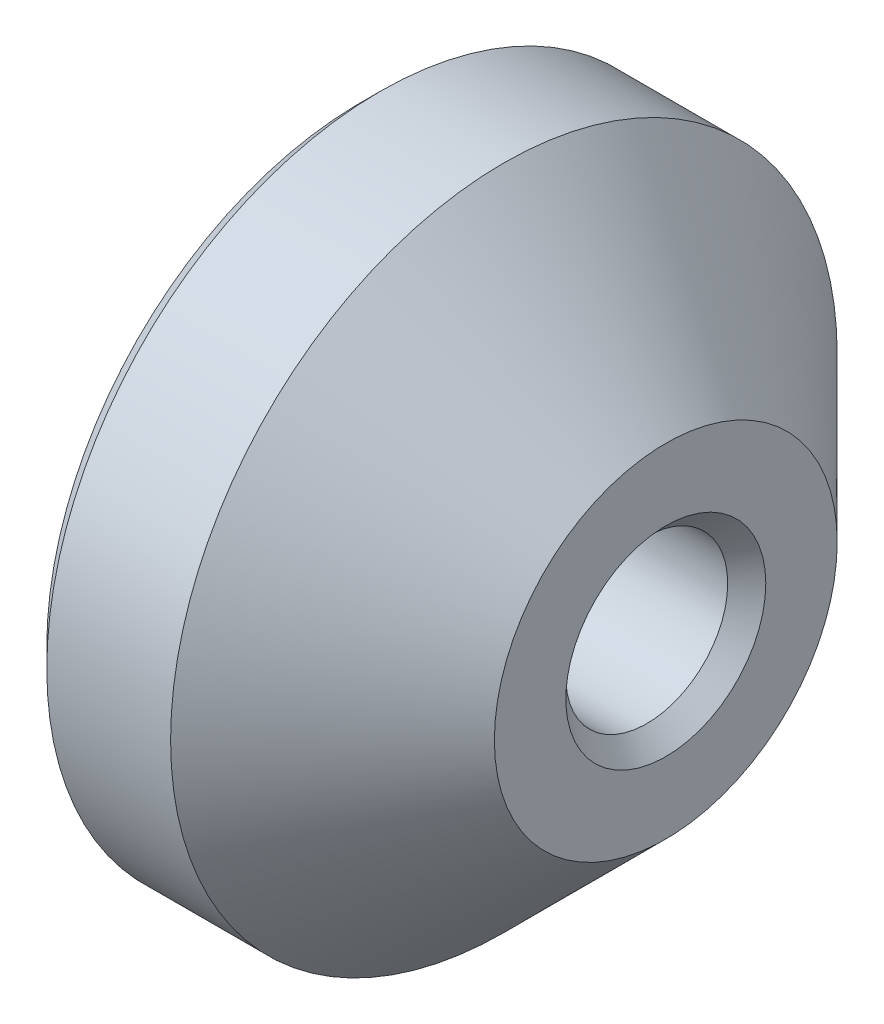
from build123d import *

# Parameters (mm, degrees)
M10_GEWINDEKERNLOCH1_D = 8.5
FASE1_SIZE             = 1


with BuildPart() as part:
    # Skizze1 → Rotation1 (revolve)
    with BuildSketch(Plane.XY, mode=Mode.PRIVATE) as rotation1_sk:
        Polygon((0, 0), (0, 9), (-8.5, 17.5), (-16, 17.5), (-16, 0), align=None)
    revolve(rotation1_sk.sketch.rotate(Axis((0, 0, 0), (-1, 0, 0)), 90), axis=Axis((0, 0, 0), (-1, 0, 0)))

    # M10 Gewindekernloch1 (through all)
    with Locations(Plane(origin=(0, 0, 0), x_dir=(0, 0, -1), z_dir=(1, 0, 0))):
        with Locations((0, 0)):
            Hole(M10_GEWINDEKERNLOCH1_D / 2)

    # Fase1
    fase1_edges = [part.edges().sort_by_distance(p)[0] for p in [
        (0, 0, -4.25),
        (-16, 0, -4.25),
        (-16, 0, 17.5),
    ]]
    chamfer(fase1_edges, length=FASE1_SIZE)


solid = part.part
